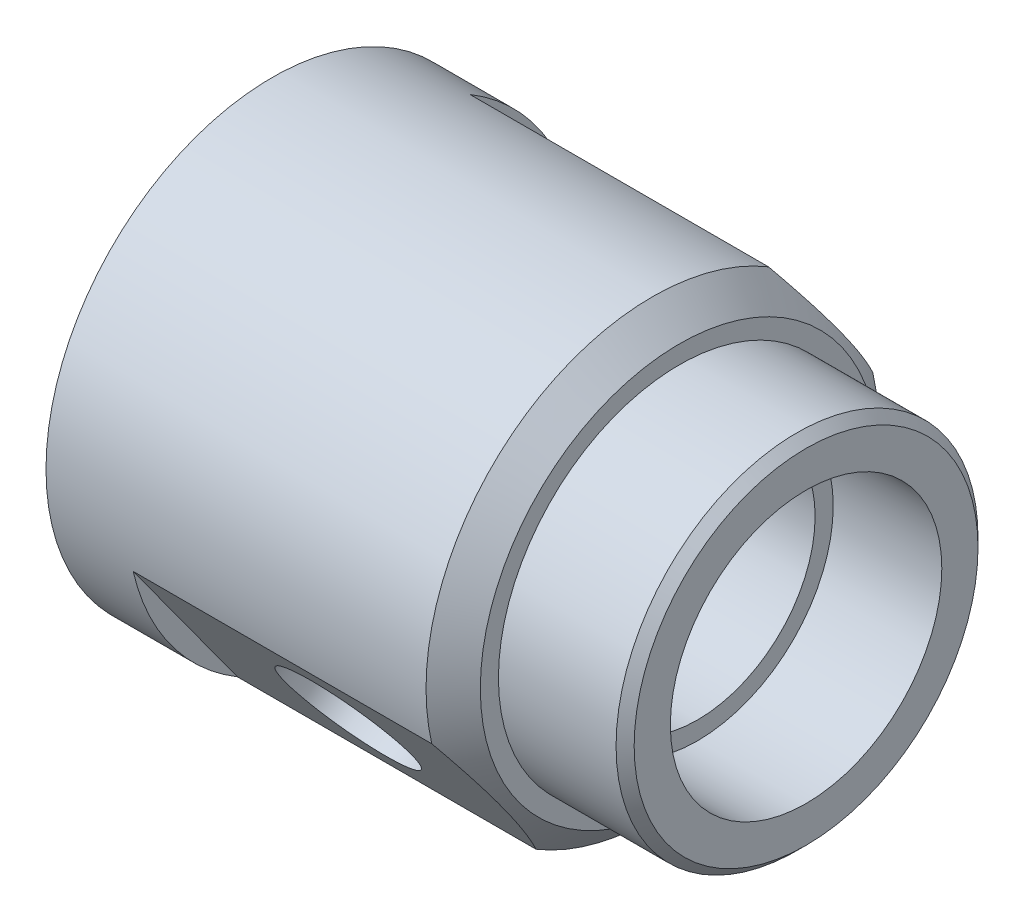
ISO-10303-21;
HEADER;
FILE_DESCRIPTION(('STEP AP214'),'2;1');
FILE_NAME('part.step','',(''),(''),'','','');
FILE_SCHEMA(('AUTOMOTIVE_DESIGN { 1 0 10303 214 1 1 1 1 }'));
ENDSEC;
DATA;
#1=APPLICATION_CONTEXT('core data for automotive mechanical design processes');
#2=APPLICATION_PROTOCOL_DEFINITION('international standard','automotive_design',2000,#1);
#3=PRODUCT_CONTEXT('',#1,'mechanical');
#4=PRODUCT('Part','Part','',(#3));
#5=PRODUCT_RELATED_PRODUCT_CATEGORY('part','',(#4));
#6=PRODUCT_DEFINITION_FORMATION('','',#4);
#7=PRODUCT_DEFINITION_CONTEXT('part definition',#1,'design');
#8=PRODUCT_DEFINITION('design','',#6,#7);
#9=PRODUCT_DEFINITION_SHAPE('','',#8);
#10=(LENGTH_UNIT() NAMED_UNIT(*) SI_UNIT(.MILLI.,.METRE.));
#11=(NAMED_UNIT(*) PLANE_ANGLE_UNIT() SI_UNIT($,.RADIAN.));
#12=(NAMED_UNIT(*) SI_UNIT($,.STERADIAN.) SOLID_ANGLE_UNIT());
#13=UNCERTAINTY_MEASURE_WITH_UNIT(LENGTH_MEASURE(1.E-05),#10,'distance_accuracy_value','');
#14=(GEOMETRIC_REPRESENTATION_CONTEXT(3) GLOBAL_UNCERTAINTY_ASSIGNED_CONTEXT((#13)) GLOBAL_UNIT_ASSIGNED_CONTEXT((#10,
#11,#12)) REPRESENTATION_CONTEXT('',''));
#15=CARTESIAN_POINT('',(0.,0.,0.));
#16=DIRECTION('',(0.,0.,1.));
#17=DIRECTION('',(1.,0.,0.));
#18=AXIS2_PLACEMENT_3D('',#15,#16,#17);
#19=CARTESIAN_POINT('',(-39.,13.079846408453,-14.600260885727));
#20=DIRECTION('',(1.,0.,0.));
#21=DIRECTION('',(0.,-0.809016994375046,-0.587785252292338));
#22=AXIS2_PLACEMENT_3D('',#19,#20,#21);
#23=PLANE('',#22);
#24=CARTESIAN_POINT('',(-39.,12.637382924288,-17.393865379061));
#25=DIRECTION('',(-1.,0.,0.));
#26=DIRECTION('',(0.,0.,1.));
#27=AXIS2_PLACEMENT_3D('',#24,#25,#26);
#28=CIRCLE('',#27,2.00000000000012);
#29=CARTESIAN_POINT('',(-39.,12.637382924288,-15.3938653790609));
#30=VERTEX_POINT('',#29);
#31=EDGE_CURVE('E251',#30,#30,#28,.F.);
#32=ORIENTED_EDGE('',*,*,#31,.F.);
#33=EDGE_LOOP('',(#32));
#34=FACE_BOUND('',#33,.T.);
#35=ADVANCED_FACE('F16',(#34),#23,.F.);
#36=CARTESIAN_POINT('',(-39.,-12.194919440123,20.187469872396));
#37=DIRECTION('',(1.,0.,0.));
#38=DIRECTION('',(0.,-0.809016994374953,-0.587785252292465));
#39=AXIS2_PLACEMENT_3D('',#36,#37,#38);
#40=PLANE('',#39);
#41=CARTESIAN_POINT('',(-39.,-12.637382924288,17.393865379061));
#42=DIRECTION('',(-1.,0.,0.));
#43=DIRECTION('',(0.,0.,1.));
#44=AXIS2_PLACEMENT_3D('',#41,#42,#43);
#45=CIRCLE('',#44,2.00000000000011);
#46=CARTESIAN_POINT('',(-39.,-12.637382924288,19.3938653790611));
#47=VERTEX_POINT('',#46);
#48=EDGE_CURVE('E248',#47,#47,#45,.F.);
#49=ORIENTED_EDGE('',*,*,#48,.F.);
#50=EDGE_LOOP('',(#49));
#51=FACE_BOUND('',#50,.T.);
#52=ADVANCED_FACE('F151',(#51),#40,.F.);
#53=CARTESIAN_POINT('',(-43.,-20.952033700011,3.3184761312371));
#54=DIRECTION('',(-1.,0.,0.));
#55=DIRECTION('',(0.,0.809016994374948,0.587785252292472));
#56=AXIS2_PLACEMENT_3D('',#53,#54,#55);
#57=PLANE('',#56);
#58=CARTESIAN_POINT('',(-43.,0.,0.));
#59=DIRECTION('',(-1.,0.,0.));
#60=DIRECTION('',(0.,0.,1.));
#61=AXIS2_PLACEMENT_3D('',#58,#59,#60);
#62=CIRCLE('',#61,12.9999999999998);
#63=CARTESIAN_POINT('',(-43.,0.,12.9999999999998));
#64=VERTEX_POINT('',#63);
#65=EDGE_CURVE('E246',#64,#64,#62,.T.);
#66=ORIENTED_EDGE('',*,*,#65,.F.);
#67=EDGE_LOOP('',(#66));
#68=FACE_BOUND('',#67,.T.);
#69=CARTESIAN_POINT('',(-43.0000000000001,0.,0.));
#70=DIRECTION('',(-1.,0.,0.));
#71=DIRECTION('',(0.,0.,1.));
#72=AXIS2_PLACEMENT_3D('',#69,#70,#71);
#73=CIRCLE('',#72,14.9999999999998);
#74=CARTESIAN_POINT('',(-43.0000000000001,0.,14.9999999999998));
#75=VERTEX_POINT('',#74);
#76=EDGE_CURVE('E260',#75,#75,#73,.F.);
#77=ORIENTED_EDGE('',*,*,#76,.F.);
#78=EDGE_LOOP('',(#77));
#79=FACE_BOUND('',#78,.T.);
#80=ADVANCED_FACE('F155',(#68,#79),#57,.T.);
#81=CARTESIAN_POINT('',(-43.0000000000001,0.,0.));
#82=DIRECTION('',(-1.,0.,0.));
#83=DIRECTION('',(0.,0.,1.));
#84=AXIS2_PLACEMENT_3D('',#81,#82,#83);
#85=CYLINDRICAL_SURFACE('',#84,14.9999999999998);
#86=ORIENTED_EDGE('',*,*,#76,.T.);
#87=EDGE_LOOP('',(#86));
#88=FACE_BOUND('',#87,.T.);
#89=CARTESIAN_POINT('',(-47.,0.,0.));
#90=DIRECTION('',(-1.,0.,0.));
#91=DIRECTION('',(0.,0.,1.));
#92=AXIS2_PLACEMENT_3D('',#89,#90,#91);
#93=CIRCLE('',#92,14.9999999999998);
#94=CARTESIAN_POINT('',(-47.,0.,14.9999999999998));
#95=VERTEX_POINT('',#94);
#96=EDGE_CURVE('E207',#95,#95,#93,.F.);
#97=ORIENTED_EDGE('',*,*,#96,.F.);
#98=EDGE_LOOP('',(#97));
#99=FACE_BOUND('',#98,.T.);
#100=ADVANCED_FACE('F159',(#88,#99),#85,.F.);
#101=CARTESIAN_POINT('',(-39.,12.637382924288,-17.393865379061));
#102=DIRECTION('',(-1.,0.,0.));
#103=DIRECTION('',(0.,0.,1.));
#104=AXIS2_PLACEMENT_3D('',#101,#102,#103);
#105=CYLINDRICAL_SURFACE('',#104,2.00000000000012);
#106=ORIENTED_EDGE('',*,*,#31,.T.);
#107=EDGE_LOOP('',(#106));
#108=FACE_BOUND('',#107,.T.);
#109=CARTESIAN_POINT('',(-47.,12.637382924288,-17.393865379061));
#110=DIRECTION('',(-1.,0.,0.));
#111=DIRECTION('',(0.,0.,1.));
#112=AXIS2_PLACEMENT_3D('',#109,#110,#111);
#113=CIRCLE('',#112,2.00000000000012);
#114=CARTESIAN_POINT('',(-47.,12.637382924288,-15.3938653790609));
#115=VERTEX_POINT('',#114);
#116=EDGE_CURVE('E202',#115,#115,#113,.F.);
#117=ORIENTED_EDGE('',*,*,#116,.F.);
#118=EDGE_LOOP('',(#117));
#119=FACE_BOUND('',#118,.T.);
#120=ADVANCED_FACE('F268',(#108,#119),#105,.F.);
#121=CARTESIAN_POINT('',(-39.,-12.637382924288,17.393865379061));
#122=DIRECTION('',(-1.,0.,0.));
#123=DIRECTION('',(0.,0.,1.));
#124=AXIS2_PLACEMENT_3D('',#121,#122,#123);
#125=CYLINDRICAL_SURFACE('',#124,2.00000000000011);
#126=ORIENTED_EDGE('',*,*,#48,.T.);
#127=EDGE_LOOP('',(#126));
#128=FACE_BOUND('',#127,.T.);
#129=CARTESIAN_POINT('',(-47.,-12.637382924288,17.393865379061));
#130=DIRECTION('',(-1.,0.,0.));
#131=DIRECTION('',(0.,0.,1.));
#132=AXIS2_PLACEMENT_3D('',#129,#130,#131);
#133=CIRCLE('',#132,2.00000000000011);
#134=CARTESIAN_POINT('',(-47.,-12.637382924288,19.3938653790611));
#135=VERTEX_POINT('',#134);
#136=EDGE_CURVE('E197',#135,#135,#133,.F.);
#137=ORIENTED_EDGE('',*,*,#136,.F.);
#138=EDGE_LOOP('',(#137));
#139=FACE_BOUND('',#138,.T.);
#140=ADVANCED_FACE('F232',(#128,#139),#125,.F.);
#141=CARTESIAN_POINT('',(0.,0.,0.));
#142=DIRECTION('',(-1.,0.,0.));
#143=DIRECTION('',(0.,0.,1.));
#144=AXIS2_PLACEMENT_3D('',#141,#142,#143);
#145=CYLINDRICAL_SURFACE('',#144,12.9999999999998);
#146=ORIENTED_EDGE('',*,*,#65,.T.);
#147=EDGE_LOOP('',(#146));
#148=FACE_BOUND('',#147,.T.);
#149=CARTESIAN_POINT('',(-26.9401139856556,-6.88486211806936,11.0271788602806));
#150=CARTESIAN_POINT('',(-26.9001265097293,-6.6265743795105,11.1884434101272));
#151=CARTESIAN_POINT('',(-26.8402386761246,-6.36482471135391,11.3391824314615));
#152=CARTESIAN_POINT('',(-26.6820678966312,-5.83846807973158,11.6190329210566));
#153=CARTESIAN_POINT('',(-26.5834697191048,-5.57385545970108,11.7479540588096));
#154=CARTESIAN_POINT('',(-26.3496849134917,-5.04742414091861,11.9836373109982));
#155=CARTESIAN_POINT('',(-26.2141434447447,-4.78565956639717,12.090165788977));
#156=CARTESIAN_POINT('',(-25.9088063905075,-4.27094860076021,12.2814951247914));
#157=CARTESIAN_POINT('',(-25.738705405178,-4.01810623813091,12.3660857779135));
#158=CARTESIAN_POINT('',(-25.367075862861,-3.52756117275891,12.5148890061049));
#159=CARTESIAN_POINT('',(-25.1653561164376,-3.28996385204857,12.5789698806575));
#160=CARTESIAN_POINT('',(-24.7337794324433,-2.8364048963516,12.688946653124));
#161=CARTESIAN_POINT('',(-24.5038755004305,-2.62048051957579,12.7348116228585));
#162=CARTESIAN_POINT('',(-24.0196634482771,-2.21675606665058,12.8112476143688));
#163=CARTESIAN_POINT('',(-23.7654464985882,-2.02885719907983,12.8418732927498));
#164=CARTESIAN_POINT('',(-23.2367581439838,-1.68738478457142,12.8911705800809));
#165=CARTESIAN_POINT('',(-22.9624723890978,-1.53353924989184,12.9099393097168));
#166=CARTESIAN_POINT('',(-22.3982036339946,-1.26571193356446,12.9389328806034));
#167=CARTESIAN_POINT('',(-22.1084254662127,-1.15131198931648,12.9492490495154));
#168=CARTESIAN_POINT('',(-21.5181284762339,-0.966775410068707,12.9643324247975));
#169=CARTESIAN_POINT('',(-21.2177527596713,-0.896190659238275,12.9691562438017));
#170=CARTESIAN_POINT('',(-20.6115534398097,-0.802033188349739,12.975323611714));
#171=CARTESIAN_POINT('',(-20.3057767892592,-0.778163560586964,12.9766891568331));
#172=CARTESIAN_POINT('',(-19.6942235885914,-0.778163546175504,12.9766891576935));
#173=CARTESIAN_POINT('',(-19.3884470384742,-0.802033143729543,12.9753236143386));
#174=CARTESIAN_POINT('',(-18.7822478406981,-0.896190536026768,12.9691562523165));
#175=CARTESIAN_POINT('',(-18.4818721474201,-0.966775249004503,12.9643324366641));
#176=CARTESIAN_POINT('',(-17.891575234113,-1.15131173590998,12.9492490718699));
#177=CARTESIAN_POINT('',(-17.6017971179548,-1.26571162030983,12.9389329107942));
#178=CARTESIAN_POINT('',(-17.0375285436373,-1.53353876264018,12.9099393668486));
#179=CARTESIAN_POINT('',(-16.7632429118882,-1.6873841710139,12.8911706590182));
#180=CARTESIAN_POINT('',(-16.2345552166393,-2.02885602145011,12.8418734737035));
#181=CARTESIAN_POINT('',(-15.9803387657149,-2.21675439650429,12.8112478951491));
#182=CARTESIAN_POINT('',(-15.4961281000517,-2.62047733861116,12.7348122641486));
#183=CARTESIAN_POINT('',(-15.2662250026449,-2.83640063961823,12.688947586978));
#184=CARTESIAN_POINT('',(-14.8346475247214,-3.28995961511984,12.5789710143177));
#185=CARTESIAN_POINT('',(-14.6329264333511,-3.52755825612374,12.514889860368));
#186=CARTESIAN_POINT('',(-14.2612955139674,-4.01810490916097,12.3660862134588));
#187=CARTESIAN_POINT('',(-14.0911943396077,-4.27094745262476,12.2814955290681));
#188=CARTESIAN_POINT('',(-13.7858570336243,-4.78565867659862,12.0901661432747));
#189=CARTESIAN_POINT('',(-13.6503154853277,-5.04742332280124,11.9836376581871));
#190=CARTESIAN_POINT('',(-13.4165305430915,-5.57385478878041,11.7479543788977));
#191=CARTESIAN_POINT('',(-13.3179323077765,-5.83846748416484,11.6190332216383));
#192=CARTESIAN_POINT('',(-13.1597614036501,-6.3648243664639,11.339182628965));
#193=CARTESIAN_POINT('',(-13.0998735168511,-6.62657420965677,11.1884435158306));
#194=CARTESIAN_POINT('',(-13.0200858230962,-7.14194014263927,10.8666696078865));
#195=CARTESIAN_POINT('',(-13.0000000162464,-7.39558858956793,10.6957331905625));
#196=CARTESIAN_POINT('',(-12.9999999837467,-7.89013242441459,10.3363074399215));
#197=CARTESIAN_POINT('',(-13.0200861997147,-8.13102767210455,10.1478179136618));
#198=CARTESIAN_POINT('',(-13.099873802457,-8.59619685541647,9.75695442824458));
#199=CARTESIAN_POINT('',(-13.1597620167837,-8.82038683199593,9.55451904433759));
#200=CARTESIAN_POINT('',(-13.3179327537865,-9.2490813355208,9.14024833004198));
#201=CARTESIAN_POINT('',(-13.4165311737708,-9.45340618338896,8.92834870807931));
#202=CARTESIAN_POINT('',(-13.6503158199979,-9.84011906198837,8.50036016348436));
#203=CARTESIAN_POINT('',(-13.7858573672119,-10.022267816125,8.28425053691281));
#204=CARTESIAN_POINT('',(-14.0911941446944,-10.3631776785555,7.8537053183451));
#205=CARTESIAN_POINT('',(-14.2612950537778,-10.521706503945,7.63930377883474));
#206=CARTESIAN_POINT('',(-14.6329242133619,-10.8147072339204,7.21860494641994));
#207=CARTESIAN_POINT('',(-14.8346437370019,-10.9490212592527,7.01236723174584));
#208=CARTESIAN_POINT('',(-15.2662199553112,-11.1936717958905,6.61485347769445));
#209=CARTESIAN_POINT('',(-15.496123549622,-11.3039674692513,6.42360326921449));
#210=CARTESIAN_POINT('',(-15.9803351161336,-11.501327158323,6.06313118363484));
#211=CARTESIAN_POINT('',(-16.2345516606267,-11.5884738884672,5.8938320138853));
#212=CARTESIAN_POINT('',(-16.763239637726,-11.7407976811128,5.58419436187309));
#213=CARTESIAN_POINT('',(-17.0375250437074,-11.8061514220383,5.44362674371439));
#214=CARTESIAN_POINT('',(-17.6017937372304,-11.9164230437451,5.19777642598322));
#215=CARTESIAN_POINT('',(-17.8915717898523,-11.9615572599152,5.09212353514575));
#216=CARTESIAN_POINT('',(-18.481869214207,-12.0328805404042,4.9212152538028));
#217=CARTESIAN_POINT('',(-18.7822451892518,-12.0592621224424,4.85555037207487));
#218=CARTESIAN_POINT('',(-19.3884453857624,-12.0941995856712,4.76787348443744));
#219=CARTESIAN_POINT('',(-19.6942225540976,-12.1028682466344,4.74558533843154));
#220=CARTESIAN_POINT('',(-20.3057768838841,-12.1028682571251,4.74558531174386));
#221=CARTESIAN_POINT('',(-20.6115540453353,-12.0941996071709,4.76787342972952));
#222=CARTESIAN_POINT('',(-21.217754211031,-12.0592621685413,4.85555025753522));
#223=CARTESIAN_POINT('',(-21.5181301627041,-12.0328806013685,4.92121510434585));
#224=CARTESIAN_POINT('',(-22.10842751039,-11.9615573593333,5.09212330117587));
#225=CARTESIAN_POINT('',(-22.3982055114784,-11.9164231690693,5.19777613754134));
#226=CARTESIAN_POINT('',(-22.9624740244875,-11.8061516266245,5.44362629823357));
#227=CARTESIAN_POINT('',(-23.2367593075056,-11.7407979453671,5.58419380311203));
#228=CARTESIAN_POINT('',(-23.7654466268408,-11.5884744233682,5.89383095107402));
#229=CARTESIAN_POINT('',(-24.0196626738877,-11.5013279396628,6.06312968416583));
#230=CARTESIAN_POINT('',(-24.503872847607,-11.3039690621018,6.42360043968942));
#231=CARTESIAN_POINT('',(-24.7337756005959,-11.1936740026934,6.61484970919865));
#232=CARTESIAN_POINT('',(-25.1653526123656,-10.9490236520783,7.01236354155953));
#233=CARTESIAN_POINT('',(-25.3670734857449,-10.8147089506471,7.21860243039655));
#234=CARTESIAN_POINT('',(-25.7387040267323,-10.5217073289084,7.63930264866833));
#235=CARTESIAN_POINT('',(-25.9088051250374,-10.3631784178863,7.85370435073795));
#236=CARTESIAN_POINT('',(-26.2141421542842,-10.0222684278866,8.28424979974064));
#237=CARTESIAN_POINT('',(-26.3496837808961,-9.84011964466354,8.50035949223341));
#238=CARTESIAN_POINT('',(-26.583468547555,-9.45340672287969,8.92834813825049));
#239=CARTESIAN_POINT('',(-26.6820670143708,-9.24908186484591,9.14024779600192));
#240=CARTESIAN_POINT('',(-26.8402378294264,-8.82038734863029,9.55451856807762));
#241=CARTESIAN_POINT('',(-26.9001260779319,-8.59619737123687,9.75695397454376));
#242=CARTESIAN_POINT('',(-26.9799137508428,-8.13102814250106,10.1478175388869));
#243=CARTESIAN_POINT('',(-26.9999999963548,-7.89013284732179,10.3363071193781));
#244=CARTESIAN_POINT('',(-27.0000000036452,-7.39558884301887,10.6957330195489));
#245=CARTESIAN_POINT('',(-26.9799141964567,-7.14194027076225,10.8666695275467));
#246=CARTESIAN_POINT('',(-26.9401139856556,-6.88486211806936,11.0271788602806));
#247=B_SPLINE_CURVE_WITH_KNOTS('',3,(#149,#150,#151,#152,#153,#154,#155,#156,#157,#158,#159,
#160,#161,#162,#163,#164,#165,#166,#167,#168,#169,#170,#171,#172,#173,#174,#175,#176,#177,#178,
#179,#180,#181,#182,#183,#184,#185,#186,#187,#188,#189,#190,#191,#192,#193,#194,#195,#196,#197,
#198,#199,#200,#201,#202,#203,#204,#205,#206,#207,#208,#209,#210,#211,#212,#213,#214,#215,#216,
#217,#218,#219,#220,#221,#222,#223,#224,#225,#226,#227,#228,#229,#230,#231,#232,#233,#234,#235,
#236,#237,#238,#239,#240,#241,#242,#243,#244,#245,#246),.UNSPECIFIED.,.T.,.F.,(4,2,2,2,2,2,2,2,
2,2,2,2,2,2,2,2,2,2,2,2,2,2,2,2,2,2,2,2,2,2,2,2,2,2,2,2,2,2,2,2,2,2,2,2,2,2,2,2,4),(0.,
0.920514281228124,1.84868551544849,2.78610671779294,3.73220339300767,4.68425876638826,
5.63792376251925,6.58814327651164,7.53047499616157,8.46248557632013,9.38479988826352,
10.301232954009,11.2176657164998,12.1399799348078,13.0719903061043,14.0143215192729,
14.9645389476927,15.9181998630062,16.8702608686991,17.8163583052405,18.7537797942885,
19.6819512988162,20.6024661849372,21.518669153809,22.4348821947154,23.3554265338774,
24.2836446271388,25.2211262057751,26.1672921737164,27.119420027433,28.0731543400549,
29.0234335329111,29.9658099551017,30.897847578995,31.8201728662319,32.7366070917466,
33.6530412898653,34.575366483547,35.5074038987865,36.4497798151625,37.4000569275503,
38.3537871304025,39.3059206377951,40.2520873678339,41.18956923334,42.1177874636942,
43.0383318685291,43.9545451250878,44.8707485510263),.UNSPECIFIED.);
#248=CARTESIAN_POINT('',(-26.9401139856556,-6.88486211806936,11.0271788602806));
#249=VERTEX_POINT('',#248);
#250=EDGE_CURVE('E212',#249,#249,#247,.T.);
#251=ORIENTED_EDGE('',*,*,#250,.F.);
#252=EDGE_LOOP('',(#251));
#253=FACE_BOUND('',#252,.T.);
#254=CARTESIAN_POINT('',(-26.9401139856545,6.88139060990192,-11.0293455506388));
#255=CARTESIAN_POINT('',(-26.9001261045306,6.62304375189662,-11.1905340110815));
#256=CARTESIAN_POINT('',(-26.8402379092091,6.36123790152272,-11.3411952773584));
#257=CARTESIAN_POINT('',(-26.6820672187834,5.83476934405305,-11.6208911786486));
#258=CARTESIAN_POINT('',(-26.5834688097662,5.57010101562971,-11.7497350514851));
#259=CARTESIAN_POINT('',(-26.349684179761,5.04355890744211,-11.9852651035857));
#260=CARTESIAN_POINT('',(-26.214142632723,4.78173937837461,-12.0917173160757));
#261=CARTESIAN_POINT('',(-25.9088058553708,4.26691960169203,-12.2828960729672));
#262=CARTESIAN_POINT('',(-25.7387049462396,4.0140235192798,-12.3674122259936));
#263=CARTESIAN_POINT('',(-25.3670757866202,3.52337294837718,-12.5160693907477));
#264=CARTESIAN_POINT('',(-25.165356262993,3.28572390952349,-12.5800786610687));
#265=CARTESIAN_POINT('',(-24.7337800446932,2.83206468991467,-12.6899166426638));
#266=CARTESIAN_POINT('',(-24.5038764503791,2.61609169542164,-12.7357144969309));
#267=CARTESIAN_POINT('',(-24.019664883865,2.21227487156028,-12.8120227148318));
#268=CARTESIAN_POINT('',(-23.7654483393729,2.02433197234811,-12.8425878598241));
#269=CARTESIAN_POINT('',(-23.2367603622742,1.68277842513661,-12.8917730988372));
#270=CARTESIAN_POINT('',(-22.9624749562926,1.52889525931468,-12.9104904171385));
#271=CARTESIAN_POINT('',(-22.3982062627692,1.26100190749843,-12.9393930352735));
#272=CARTESIAN_POINT('',(-22.1084282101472,1.14657279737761,-12.9496696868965));
#273=CARTESIAN_POINT('',(-21.5181307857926,0.961989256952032,-12.9646885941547));
#274=CARTESIAN_POINT('',(-21.217754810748,0.891385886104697,-12.9694874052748));
#275=CARTESIAN_POINT('',(-20.6115546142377,0.797203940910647,-12.9756212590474));
#276=CARTESIAN_POINT('',(-20.3057774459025,0.773327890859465,-12.9769782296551));
#277=CARTESIAN_POINT('',(-19.6942231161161,0.773327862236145,-12.9769782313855));
#278=CARTESIAN_POINT('',(-19.3884459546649,0.797203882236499,-12.9756212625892));
#279=CARTESIAN_POINT('',(-18.7822457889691,0.891385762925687,-12.9694874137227));
#280=CARTESIAN_POINT('',(-18.4818698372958,0.961989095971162,-12.9646886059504));
#281=CARTESIAN_POINT('',(-17.8915724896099,1.14657254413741,-12.949669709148));
#282=CARTESIAN_POINT('',(-17.6017944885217,1.26100159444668,-12.9393930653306));
#283=CARTESIAN_POINT('',(-17.0375259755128,1.52889477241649,-12.9104904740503));
#284=CARTESIAN_POINT('',(-16.7632406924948,1.68277781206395,-12.8917731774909));
#285=CARTESIAN_POINT('',(-16.2345533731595,2.02433079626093,-12.8425880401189));
#286=CARTESIAN_POINT('',(-15.9803373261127,2.21227320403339,-12.8120229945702));
#287=CARTESIAN_POINT('',(-15.4961271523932,2.61608851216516,-12.7357151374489));
#288=CARTESIAN_POINT('',(-15.2662243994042,2.83206042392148,-12.6899175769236));
#289=CARTESIAN_POINT('',(-14.8346473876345,3.28571966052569,-12.5800797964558));
#290=CARTESIAN_POINT('',(-14.6329265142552,3.52337002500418,-12.5160702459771));
#291=CARTESIAN_POINT('',(-14.2612959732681,4.01402218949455,-12.3674126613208));
#292=CARTESIAN_POINT('',(-14.0911948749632,4.26691845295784,-12.2828964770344));
#293=CARTESIAN_POINT('',(-13.7858578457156,4.7817384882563,-12.0917176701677));
#294=CARTESIAN_POINT('',(-13.6503162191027,5.04355808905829,-11.9852654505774));
#295=CARTESIAN_POINT('',(-13.4165314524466,5.57010034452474,-11.7497353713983));
#296=CARTESIAN_POINT('',(-13.3179329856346,5.83476874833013,-11.620891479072));
#297=CARTESIAN_POINT('',(-13.1597621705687,6.36123755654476,-11.3411954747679));
#298=CARTESIAN_POINT('',(-13.0998739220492,6.62304358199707,-11.1905341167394));
#299=CARTESIAN_POINT('',(-13.0200862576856,7.13852206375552,-10.8689154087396));
#300=CARTESIAN_POINT('',(-13.000000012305,7.3922269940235,-10.6980568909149));
#301=CARTESIAN_POINT('',(-12.9999999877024,7.88688366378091,-10.3387864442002));
#302=CARTESIAN_POINT('',(-13.0200857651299,8.12783554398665,-10.1503747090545));
#303=CARTESIAN_POINT('',(-13.099873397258,8.5931175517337,-9.75966622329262));
#304=CARTESIAN_POINT('',(-13.1597612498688,8.81736411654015,-9.55730829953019));
#305=CARTESIAN_POINT('',(-13.3179320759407,9.24617105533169,-9.14319180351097));
#306=CARTESIAN_POINT('',(-13.4165302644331,9.45055217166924,-8.93136903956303));
#307=CARTESIAN_POINT('',(-13.6503150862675,9.83737651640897,-8.50353320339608));
#308=CARTESIAN_POINT('',(-13.7858565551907,10.0195808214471,-8.28749940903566));
#309=CARTESIAN_POINT('',(-14.0911936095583,10.3606002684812,-7.85710420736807));
#310=CARTESIAN_POINT('',(-14.2612945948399,10.5191833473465,-7.64277678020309));
#311=CARTESIAN_POINT('',(-14.6329241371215,10.8122903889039,-7.22222342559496));
#312=CARTESIAN_POINT('',(-14.8346438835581,10.9466565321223,-7.01605702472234));
#313=CARTESIAN_POINT('',(-15.2662205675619,11.1914080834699,-6.61868151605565));
#314=CARTESIAN_POINT('',(-15.496124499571,11.3017525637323,-6.42749828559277));
#315=CARTESIAN_POINT('',(-15.9803365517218,11.4992052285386,-6.06715353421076));
#316=CARTESIAN_POINT('',(-16.2345535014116,11.5863959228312,-5.89791494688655));
#317=CARTESIAN_POINT('',(-16.7632418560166,11.7388012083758,-5.58838908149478));
#318=CARTESIAN_POINT('',(-17.0375276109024,11.8041922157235,-5.44787313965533));
#319=CARTESIAN_POINT('',(-17.6017963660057,11.914529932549,-5.20211373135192));
#320=CARTESIAN_POINT('',(-17.8915745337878,11.9596927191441,-5.09650079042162));
#321=CARTESIAN_POINT('',(-18.4818715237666,12.0310628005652,-4.92565709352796));
#322=CARTESIAN_POINT('',(-18.7822472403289,12.0574624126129,-4.86001764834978));
#323=CARTESIAN_POINT('',(-19.3884465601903,12.0924241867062,-4.77237439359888));
#324=CARTESIAN_POINT('',(-19.6942232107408,12.1010990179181,-4.75009500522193));
#325=CARTESIAN_POINT('',(-20.3057764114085,12.1010990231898,-4.7500949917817));
#326=CARTESIAN_POINT('',(-20.6115529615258,12.0924242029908,-4.77237435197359));
#327=CARTESIAN_POINT('',(-21.217752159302,12.0574624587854,-4.86001753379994));
#328=CARTESIAN_POINT('',(-21.5181278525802,12.0310628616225,-4.92565694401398));
#329=CARTESIAN_POINT('',(-22.1084247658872,11.9596928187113,-5.09650055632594));
#330=CARTESIAN_POINT('',(-22.3982028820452,11.914530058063,-5.20211344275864));
#331=CARTESIAN_POINT('',(-22.9624714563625,11.8041924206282,-5.44787269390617));
#332=CARTESIAN_POINT('',(-23.2367570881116,11.7388014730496,-5.58838852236));
#333=CARTESIAN_POINT('',(-23.7654447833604,11.5863964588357,-5.8979138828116));
#334=CARTESIAN_POINT('',(-24.0196612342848,11.499206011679,-6.06715203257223));
#335=CARTESIAN_POINT('',(-24.503871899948,11.3017541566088,-6.42749545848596));
#336=CARTESIAN_POINT('',(-24.7337749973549,11.1914102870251,-6.61867775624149));
#337=CARTESIAN_POINT('',(-25.1653524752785,10.9466589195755,-7.01605334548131));
#338=CARTESIAN_POINT('',(-25.3670735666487,10.8122921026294,-7.22222091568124));
#339=CARTESIAN_POINT('',(-25.7387044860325,10.5191841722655,-7.64277565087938));
#340=CARTESIAN_POINT('',(-25.9088056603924,10.3606010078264,-7.85710324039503));
#341=CARTESIAN_POINT('',(-26.214142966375,10.0195814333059,-8.28749867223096));
#342=CARTESIAN_POINT('',(-26.3496845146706,9.8373770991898,-8.50353253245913));
#343=CARTESIAN_POINT('',(-26.5834694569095,9.45055271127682,-8.93136846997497));
#344=CARTESIAN_POINT('',(-26.682067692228,9.24617158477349,-9.14319126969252));
#345=CARTESIAN_POINT('',(-26.8402385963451,8.81736463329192,-9.55730782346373));
#346=CARTESIAN_POINT('',(-26.9001264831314,8.59311806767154,-9.75966576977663));
#347=CARTESIAN_POINT('',(-26.9799141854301,8.12783601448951,-10.1503743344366));
#348=CARTESIAN_POINT('',(-26.9999999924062,7.88688408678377,-10.3387861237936));
#349=CARTESIAN_POINT('',(-27.0000000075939,7.39222724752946,-10.6980567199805));
#350=CARTESIAN_POINT('',(-26.9799137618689,7.1385221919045,-10.8689153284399));
#351=CARTESIAN_POINT('',(-26.9401139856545,6.88139060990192,-11.0293455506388));
#352=B_SPLINE_CURVE_WITH_KNOTS('',3,(#254,#255,#256,#257,#258,#259,#260,#261,#262,#263,#264,
#265,#266,#267,#268,#269,#270,#271,#272,#273,#274,#275,#276,#277,#278,#279,#280,#281,#282,#283,
#284,#285,#286,#287,#288,#289,#290,#291,#292,#293,#294,#295,#296,#297,#298,#299,#300,#301,#302,
#303,#304,#305,#306,#307,#308,#309,#310,#311,#312,#313,#314,#315,#316,#317,#318,#319,#320,#321,
#322,#323,#324,#325,#326,#327,#328,#329,#330,#331,#332,#333,#334,#335,#336,#337,#338,#339,#340,
#341,#342,#343,#344,#345,#346,#347,#348,#349,#350,#351),.UNSPECIFIED.,.T.,.F.,(4,2,2,2,2,2,2,2,
2,2,2,2,2,2,2,2,2,2,2,2,2,2,2,2,2,2,2,2,2,2,2,2,2,2,2,2,2,2,2,2,2,2,2,2,2,2,2,2,4),(0.,
0.920543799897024,1.8487617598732,2.78624333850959,3.73240930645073,4.68453716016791,
5.6382714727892,6.58855066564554,7.53092708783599,8.46296471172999,9.38528999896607,
10.3017242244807,11.2181584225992,12.1404836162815,13.0725210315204,14.0148969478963,
14.9651740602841,15.9189042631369,16.8710377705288,17.8172045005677,18.7546863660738,
19.6829045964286,20.6034490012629,21.5196620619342,22.4358650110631,23.3563798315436,
24.2845511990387,25.2219724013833,26.1680690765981,27.120124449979,28.0737894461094,
29.0240089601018,29.9663406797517,30.8983512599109,31.8206655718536,32.737098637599,
33.6535314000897,34.5758456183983,35.5078559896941,36.4501872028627,37.4004046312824,
38.354065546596,39.306126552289,40.2522239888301,41.189645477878,42.1178169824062,
43.038331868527,43.9545350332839,44.8707485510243),.UNSPECIFIED.);
#353=CARTESIAN_POINT('',(-26.9401139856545,6.88139060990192,-11.0293455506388));
#354=VERTEX_POINT('',#353);
#355=EDGE_CURVE('E221',#354,#354,#352,.T.);
#356=ORIENTED_EDGE('',*,*,#355,.F.);
#357=EDGE_LOOP('',(#356));
#358=FACE_BOUND('',#357,.T.);
#359=CARTESIAN_POINT('',(0.,0.,0.));
#360=DIRECTION('',(-1.,0.,0.));
#361=DIRECTION('',(0.,0.,1.));
#362=AXIS2_PLACEMENT_3D('',#359,#360,#361);
#363=CIRCLE('',#362,12.9999999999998);
#364=CARTESIAN_POINT('',(0.,0.,12.9999999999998));
#365=VERTEX_POINT('',#364);
#366=EDGE_CURVE('E96',#365,#365,#363,.T.);
#367=ORIENTED_EDGE('',*,*,#366,.F.);
#368=EDGE_LOOP('',(#367));
#369=FACE_BOUND('',#368,.T.);
#370=ADVANCED_FACE('F227',(#148,#253,#358,#369),#145,.F.);
#371=CARTESIAN_POINT('',(-20.,6.39396105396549,-8.80400480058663));
#372=DIRECTION('',(0.,0.587785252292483,-0.809016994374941));
#373=DIRECTION('',(0.,0.809016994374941,0.587785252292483));
#374=AXIS2_PLACEMENT_3D('',#371,#372,#373);
#375=CYLINDRICAL_SURFACE('',#374,7.);
#376=CARTESIAN_POINT('',(-20.,13.517409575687,-18.608590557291));
#377=DIRECTION('',(0.,0.587785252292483,-0.809016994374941));
#378=DIRECTION('',(0.,0.809016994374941,0.587785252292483));
#379=AXIS2_PLACEMENT_3D('',#376,#377,#378);
#380=CIRCLE('',#379,7.);
#381=CARTESIAN_POINT('',(-20.,19.1805285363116,-14.4940937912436));
#382=VERTEX_POINT('',#381);
#383=EDGE_CURVE('E95',#382,#382,#380,.T.);
#384=ORIENTED_EDGE('',*,*,#383,.T.);
#385=EDGE_LOOP('',(#384));
#386=FACE_BOUND('',#385,.T.);
#387=ORIENTED_EDGE('',*,*,#355,.T.);
#388=EDGE_LOOP('',(#387));
#389=FACE_BOUND('',#388,.T.);
#390=ADVANCED_FACE('F231',(#386,#389),#375,.F.);
#391=CARTESIAN_POINT('',(-20.,-13.520712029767,18.606191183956));
#392=DIRECTION('',(0.,0.587785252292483,-0.809016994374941));
#393=DIRECTION('',(0.,0.809016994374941,0.587785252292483));
#394=AXIS2_PLACEMENT_3D('',#391,#392,#393);
#395=CYLINDRICAL_SURFACE('',#394,7.);
#396=ORIENTED_EDGE('',*,*,#250,.T.);
#397=EDGE_LOOP('',(#396));
#398=FACE_BOUND('',#397,.T.);
#399=CARTESIAN_POINT('',(-20.,-13.520712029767,18.606191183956));
#400=DIRECTION('',(0.,0.587785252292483,-0.809016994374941));
#401=DIRECTION('',(0.,0.809016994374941,0.587785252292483));
#402=AXIS2_PLACEMENT_3D('',#399,#400,#401);
#403=CIRCLE('',#402,7.);
#404=CARTESIAN_POINT('',(-20.,-7.85759306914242,22.7206879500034));
#405=VERTEX_POINT('',#404);
#406=EDGE_CURVE('E99',#405,#405,#403,.F.);
#407=ORIENTED_EDGE('',*,*,#406,.T.);
#408=EDGE_LOOP('',(#407));
#409=FACE_BOUND('',#408,.T.);
#410=ADVANCED_FACE('F165',(#398,#409),#395,.F.);
#411=CARTESIAN_POINT('',(-47.,-34.920056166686,5.5307935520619));
#412=DIRECTION('',(-1.,0.,0.));
#413=DIRECTION('',(0.,0.809016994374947,0.587785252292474));
#414=AXIS2_PLACEMENT_3D('',#411,#412,#413);
#415=PLANE('',#414);
#416=ORIENTED_EDGE('',*,*,#136,.T.);
#417=EDGE_LOOP('',(#416));
#418=FACE_BOUND('',#417,.T.);
#419=ORIENTED_EDGE('',*,*,#116,.T.);
#420=EDGE_LOOP('',(#419));
#421=FACE_BOUND('',#420,.T.);
#422=ORIENTED_EDGE('',*,*,#96,.T.);
#423=EDGE_LOOP('',(#422));
#424=FACE_BOUND('',#423,.T.);
#425=CARTESIAN_POINT('',(-47.,0.,0.));
#426=DIRECTION('',(-1.,0.,0.));
#427=DIRECTION('',(0.,0.,1.));
#428=AXIS2_PLACEMENT_3D('',#425,#426,#427);
#429=CIRCLE('',#428,25.0000000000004);
#430=CARTESIAN_POINT('',(-47.,0.,25.0000000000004));
#431=VERTEX_POINT('',#430);
#432=EDGE_CURVE('E102',#431,#431,#429,.T.);
#433=ORIENTED_EDGE('',*,*,#432,.T.);
#434=EDGE_LOOP('',(#433));
#435=FACE_BOUND('',#434,.T.);
#436=ADVANCED_FACE('F161',(#418,#421,#424,#435),#415,.T.);
#437=CARTESIAN_POINT('',(-38.,22.621346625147,-14.466329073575));
#438=DIRECTION('',(-1.,0.,0.));
#439=DIRECTION('',(0.,-0.809016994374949,-0.587785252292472));
#440=AXIS2_PLACEMENT_3D('',#437,#438,#439);
#441=PLANE('',#440);
#442=CARTESIAN_POINT('',(-38.0000000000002,0.,0.));
#443=DIRECTION('',(-1.,0.,0.));
#444=DIRECTION('',(0.,0.,1.));
#445=AXIS2_PLACEMENT_3D('',#442,#443,#444);
#446=CIRCLE('',#445,25.0000000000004);
#447=CARTESIAN_POINT('',(-38.0000000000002,-5.59234548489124,24.3664866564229));
#448=VERTEX_POINT('',#447);
#449=CARTESIAN_POINT('',(-38.0000000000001,-21.4457761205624,12.8482950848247));
#450=VERTEX_POINT('',#449);
#451=EDGE_CURVE('E86',#448,#450,#446,.F.);
#452=ORIENTED_EDGE('',*,*,#451,.T.);
#453=DIRECTION('',(0.,0.809016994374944,0.587785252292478));
#454=VECTOR('',#453,1.);
#455=CARTESIAN_POINT('',(-38.,-7.2879787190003,23.1345369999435));
#456=LINE('',#455,#454);
#457=EDGE_CURVE('E97',#450,#448,#456,.T.);
#458=ORIENTED_EDGE('',*,*,#457,.T.);
#459=EDGE_LOOP('',(#452,#458));
#460=FACE_BOUND('',#459,.T.);
#461=ADVANCED_FACE('F164',(#460),#441,.F.);
#462=CARTESIAN_POINT('',(-38.,23.8991406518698,-16.2250616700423));
#463=DIRECTION('',(-1.,0.,0.));
#464=DIRECTION('',(0.,-0.809016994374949,-0.587785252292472));
#465=AXIS2_PLACEMENT_3D('',#462,#463,#464);
#466=PLANE('',#465);
#467=CARTESIAN_POINT('',(-38.0000000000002,0.,0.));
#468=DIRECTION('',(-1.,0.,0.));
#469=DIRECTION('',(0.,0.,1.));
#470=AXIS2_PLACEMENT_3D('',#467,#468,#469);
#471=CIRCLE('',#470,25.0000000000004);
#472=CARTESIAN_POINT('',(-38.0000000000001,5.59234548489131,-24.3664866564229));
#473=VERTEX_POINT('',#472);
#474=CARTESIAN_POINT('',(-38.0000000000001,21.4457761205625,-12.8482950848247));
#475=VERTEX_POINT('',#474);
#476=EDGE_CURVE('E77',#473,#475,#471,.F.);
#477=ORIENTED_EDGE('',*,*,#476,.T.);
#478=DIRECTION('',(0.,-0.809016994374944,-0.587785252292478));
#479=VECTOR('',#478,1.);
#480=CARTESIAN_POINT('',(-38.,7.2879787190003,-23.1345369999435));
#481=LINE('',#480,#479);
#482=EDGE_CURVE('E93',#475,#473,#481,.T.);
#483=ORIENTED_EDGE('',*,*,#482,.T.);
#484=EDGE_LOOP('',(#477,#483));
#485=FACE_BOUND('',#484,.T.);
#486=ADVANCED_FACE('F169',(#485),#466,.F.);
#487=CARTESIAN_POINT('',(0.,-3.3184761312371,-20.952033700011));
#488=DIRECTION('',(1.,0.,0.));
#489=DIRECTION('',(0.,0.809016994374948,0.587785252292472));
#490=AXIS2_PLACEMENT_3D('',#487,#488,#489);
#491=PLANE('',#490);
#492=ORIENTED_EDGE('',*,*,#366,.T.);
#493=EDGE_LOOP('',(#492));
#494=FACE_BOUND('',#493,.T.);
#495=CARTESIAN_POINT('',(2.68882138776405E-13,0.,0.));
#496=DIRECTION('',(-1.,0.,0.));
#497=DIRECTION('',(0.,0.,1.));
#498=AXIS2_PLACEMENT_3D('',#495,#496,#497);
#499=CIRCLE('',#498,14.9999999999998);
#500=CARTESIAN_POINT('',(2.68882138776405E-13,0.,14.9999999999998));
#501=VERTEX_POINT('',#500);
#502=EDGE_CURVE('E69',#501,#501,#499,.T.);
#503=ORIENTED_EDGE('',*,*,#502,.F.);
#504=EDGE_LOOP('',(#503));
#505=FACE_BOUND('',#504,.T.);
#506=ADVANCED_FACE('F173',(#494,#505),#491,.T.);
#507=CARTESIAN_POINT('',(-3.,21.445776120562,-12.848295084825));
#508=DIRECTION('',(0.,-0.587785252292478,0.809016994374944));
#509=DIRECTION('',(-1.,0.,0.));
#510=AXIS2_PLACEMENT_3D('',#507,#508,#509);
#511=PLANE('',#510);
#512=ORIENTED_EDGE('',*,*,#383,.F.);
#513=EDGE_LOOP('',(#512));
#514=FACE_BOUND('',#513,.T.);
#515=DIRECTION('',(1.,0.,0.));
#516=VECTOR('',#515,1.);
#517=CARTESIAN_POINT('',(-26.,21.4457761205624,-12.8482950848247));
#518=LINE('',#517,#516);
#519=CARTESIAN_POINT('',(-4.99999999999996,21.4457761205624,-12.8482950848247));
#520=VERTEX_POINT('',#519);
#521=EDGE_CURVE('E65',#475,#520,#518,.T.);
#522=ORIENTED_EDGE('',*,*,#521,.T.);
#523=CARTESIAN_POINT('',(-4.99999999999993,21.4457761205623,-12.8482950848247));
#524=CARTESIAN_POINT('',(-4.96464834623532,21.3728020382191,-12.9013138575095));
#525=CARTESIAN_POINT('',(-4.92965187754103,21.299707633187,-12.9544200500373));
#526=CARTESIAN_POINT('',(-4.5873684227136,20.5760940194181,-13.4801561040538));
#527=CARTESIAN_POINT('',(-4.30853459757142,19.9163144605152,-13.9595140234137));
#528=CARTESIAN_POINT('',(-3.9440143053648,18.9141571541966,-14.6876239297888));
#529=CARTESIAN_POINT('',(-3.83146615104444,18.5780375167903,-14.9318291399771));
#530=CARTESIAN_POINT('',(-3.625951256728,17.9019213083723,-15.4230563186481));
#531=CARTESIAN_POINT('',(-3.53297955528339,17.5619257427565,-15.6700775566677));
#532=CARTESIAN_POINT('',(-3.42368938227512,17.1087221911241,-15.9993492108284));
#533=CARTESIAN_POINT('',(-3.39791170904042,16.9969697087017,-16.0805421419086));
#534=CARTESIAN_POINT('',(-3.34323715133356,16.7484780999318,-16.2610818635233));
#535=CARTESIAN_POINT('',(-3.31490379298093,16.611656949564,-16.3604882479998));
#536=CARTESIAN_POINT('',(-3.26179676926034,16.3377739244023,-16.5594759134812));
#537=CARTESIAN_POINT('',(-3.23701785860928,16.2007127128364,-16.6590567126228));
#538=CARTESIAN_POINT('',(-3.18598129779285,15.8959470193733,-16.8804819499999));
#539=CARTESIAN_POINT('',(-3.16060101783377,15.7281454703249,-17.0023969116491));
#540=CARTESIAN_POINT('',(-3.11943494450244,15.4227071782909,-17.2243108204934));
#541=CARTESIAN_POINT('',(-3.10274352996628,15.2851494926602,-17.324252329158));
#542=CARTESIAN_POINT('',(-3.06978918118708,14.9793352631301,-17.5464393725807));
#543=CARTESIAN_POINT('',(-3.05443631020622,14.8110132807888,-17.6687324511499));
#544=CARTESIAN_POINT('',(-3.03624178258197,14.5667864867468,-17.8461736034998));
#545=CARTESIAN_POINT('',(-3.03116398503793,14.4909862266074,-17.901245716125));
#546=CARTESIAN_POINT('',(-3.02114733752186,14.3225191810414,-18.0236441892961));
#547=CARTESIAN_POINT('',(-3.01648922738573,14.2298412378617,-18.0909786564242));
#548=CARTESIAN_POINT('',(-3.00888179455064,14.0444566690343,-18.2256684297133));
#549=CARTESIAN_POINT('',(-3.00593216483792,13.9517500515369,-18.2930237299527));
#550=CARTESIAN_POINT('',(-3.00128006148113,13.7457198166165,-18.4427134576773));
#551=CARTESIAN_POINT('',(-3.00000002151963,13.6323897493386,-18.5250525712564));
#552=CARTESIAN_POINT('',(-2.999999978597,13.4063444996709,-18.6892840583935));
#553=CARTESIAN_POINT('',(-3.00126613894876,13.2936293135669,-18.7711764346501));
#554=CARTESIAN_POINT('',(-3.00689127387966,13.0431591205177,-18.9531536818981));
#555=CARTESIAN_POINT('',(-3.01187572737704,12.9054129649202,-19.0532321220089));
#556=CARTESIAN_POINT('',(-3.02561214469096,12.6299632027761,-19.2533580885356));
#557=CARTESIAN_POINT('',(-3.03436634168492,12.4922596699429,-19.3534055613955));
#558=CARTESIAN_POINT('',(-3.057985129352,12.1863187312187,-19.5756846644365));
#559=CARTESIAN_POINT('',(-3.07377752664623,12.0181275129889,-19.6978827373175));
#560=CARTESIAN_POINT('',(-3.1075294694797,11.7124594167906,-19.91996360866));
#561=CARTESIAN_POINT('',(-3.12458386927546,11.57491623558,-20.0198945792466));
#562=CARTESIAN_POINT('',(-3.16656807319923,11.2693925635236,-20.241870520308));
#563=CARTESIAN_POINT('',(-3.1924062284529,11.1014931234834,-20.3638566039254));
#564=CARTESIAN_POINT('',(-3.24947861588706,10.7659611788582,-20.6076348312));
#565=CARTESIAN_POINT('',(-3.2807233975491,10.5983298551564,-20.7294261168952));
#566=CARTESIAN_POINT('',(-3.35605226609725,10.2260909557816,-20.9998735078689));
#567=CARTESIAN_POINT('',(-3.40144325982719,10.0216553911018,-21.1484046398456));
#568=CARTESIAN_POINT('',(-3.48494386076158,9.67538571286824,-21.399984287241));
#569=CARTESIAN_POINT('',(-3.52112812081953,9.53324443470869,-21.5032559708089));
#570=CARTESIAN_POINT('',(-3.6056141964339,9.21763129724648,-21.7325623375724));
#571=CARTESIAN_POINT('',(-3.65480944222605,9.04431528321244,-21.8584837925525));
#572=CARTESIAN_POINT('',(-3.75849352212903,8.69815886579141,-22.1099811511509));
#573=CARTESIAN_POINT('',(-3.81299826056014,8.52532159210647,-22.2355547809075));
#574=CARTESIAN_POINT('',(-3.9398559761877,8.14168027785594,-22.5142865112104));
#575=CARTESIAN_POINT('',(-4.0134551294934,7.93114508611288,-22.6672492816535));
#576=CARTESIAN_POINT('',(-4.14384589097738,7.57652652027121,-22.9248947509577));
#577=CARTESIAN_POINT('',(-4.19880901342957,7.43199987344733,-23.0298995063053));
#578=CARTESIAN_POINT('',(-4.32473519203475,7.1111744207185,-23.2629928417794));
#579=CARTESIAN_POINT('',(-4.39650548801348,6.93508244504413,-23.3909311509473));
#580=CARTESIAN_POINT('',(-4.54488410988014,6.58350544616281,-23.6463667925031));
#581=CARTESIAN_POINT('',(-4.62150953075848,6.40802515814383,-23.7738606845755));
#582=CARTESIAN_POINT('',(-4.79701147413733,6.01860659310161,-24.0567898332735));
#583=CARTESIAN_POINT('',(-4.89698714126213,5.80499192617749,-24.2119899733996));
#584=CARTESIAN_POINT('',(-4.99999999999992,5.59234548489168,-24.3664866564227));
#585=B_SPLINE_CURVE_WITH_KNOTS('',3,(#523,#524,#525,#526,#527,#528,#529,#530,#531,#532,#533,
#534,#535,#536,#537,#538,#539,#540,#541,#542,#543,#544,#545,#546,#547,#548,#549,#550,#551,#552,
#553,#554,#555,#556,#557,#558,#559,#560,#561,#562,#563,#564,#565,#566,#567,#568,#569,#570,#571,
#572,#573,#574,#575,#576,#577,#578,#579,#580,#581,#582,#583,#584),.UNSPECIFIED.,.F.,.F.,(4,2,2,
2,2,2,2,2,2,2,2,2,2,2,2,2,2,2,2,2,2,2,2,2,2,2,2,2,2,2,4),(0.,0.290666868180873,2.87284748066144,
4.16383125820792,5.45448745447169,5.87603084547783,6.39042202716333,6.90404613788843,
7.53085233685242,8.04336137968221,8.66914435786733,8.95063474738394,9.29457356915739,
9.63845056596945,10.0586945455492,10.4766609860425,10.9876267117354,11.4988955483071,
12.1242994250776,12.6368612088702,13.2641980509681,13.892773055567,14.6628645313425,
15.2009827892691,15.8603312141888,16.5217192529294,17.3329343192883,17.8936340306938,
18.5811436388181,19.2712252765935,20.1181436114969),.UNSPECIFIED.);
#586=CARTESIAN_POINT('',(-4.99999999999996,5.59234548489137,-24.3664866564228));
#587=VERTEX_POINT('',#586);
#588=EDGE_CURVE('E61',#520,#587,#585,.T.);
#589=ORIENTED_EDGE('',*,*,#588,.T.);
#590=DIRECTION('',(-1.,0.,0.));
#591=VECTOR('',#590,1.);
#592=CARTESIAN_POINT('',(-26.,5.59234548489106,-24.3664866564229));
#593=LINE('',#592,#591);
#594=EDGE_CURVE('E64',#587,#473,#593,.T.);
#595=ORIENTED_EDGE('',*,*,#594,.T.);
#596=ORIENTED_EDGE('',*,*,#482,.F.);
#597=EDGE_LOOP('',(#522,#589,#595,#596));
#598=FACE_BOUND('',#597,.T.);
#599=ADVANCED_FACE('F63',(#514,#598),#511,.F.);
#600=CARTESIAN_POINT('',(-3.,-21.445776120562,12.848295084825));
#601=DIRECTION('',(0.,0.587785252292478,-0.809016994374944));
#602=DIRECTION('',(-1.,0.,0.));
#603=AXIS2_PLACEMENT_3D('',#600,#601,#602);
#604=PLANE('',#603);
#605=ORIENTED_EDGE('',*,*,#406,.F.);
#606=EDGE_LOOP('',(#605));
#607=FACE_BOUND('',#606,.T.);
#608=DIRECTION('',(1.,0.,0.));
#609=VECTOR('',#608,1.);
#610=CARTESIAN_POINT('',(-26.,-21.4457761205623,12.8482950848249));
#611=LINE('',#610,#609);
#612=CARTESIAN_POINT('',(-4.99999999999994,-21.4457761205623,12.8482950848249));
#613=VERTEX_POINT('',#612);
#614=EDGE_CURVE('E78',#450,#613,#611,.T.);
#615=ORIENTED_EDGE('',*,*,#614,.T.);
#616=CARTESIAN_POINT('',(-4.99999999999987,-21.4457761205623,12.8482950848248));
#617=CARTESIAN_POINT('',(-4.96464834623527,-21.372802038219,12.9013138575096));
#618=CARTESIAN_POINT('',(-4.92965187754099,-21.2997076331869,12.9544200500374));
#619=CARTESIAN_POINT('',(-4.5873684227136,-20.5760940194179,13.4801561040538));
#620=CARTESIAN_POINT('',(-4.3085345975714,-19.9163144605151,13.9595140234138));
#621=CARTESIAN_POINT('',(-3.94401430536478,-18.9141571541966,14.6876239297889));
#622=CARTESIAN_POINT('',(-3.83146615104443,-18.5780375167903,14.9318291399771));
#623=CARTESIAN_POINT('',(-3.62595125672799,-17.9019213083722,15.4230563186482));
#624=CARTESIAN_POINT('',(-3.53297955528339,-17.5619257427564,15.6700775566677));
#625=CARTESIAN_POINT('',(-3.42368938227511,-17.1087221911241,15.9993492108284));
#626=CARTESIAN_POINT('',(-3.39791170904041,-16.9969697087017,16.0805421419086));
#627=CARTESIAN_POINT('',(-3.34323715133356,-16.7484780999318,16.2610818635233));
#628=CARTESIAN_POINT('',(-3.31490379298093,-16.611656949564,16.3604882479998));
#629=CARTESIAN_POINT('',(-3.26179676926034,-16.3377739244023,16.5594759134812));
#630=CARTESIAN_POINT('',(-3.23701785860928,-16.2007127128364,16.6590567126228));
#631=CARTESIAN_POINT('',(-3.18598129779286,-15.8959470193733,16.8804819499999));
#632=CARTESIAN_POINT('',(-3.16060101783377,-15.7281454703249,17.0023969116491));
#633=CARTESIAN_POINT('',(-3.11943494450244,-15.4227071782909,17.2243108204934));
#634=CARTESIAN_POINT('',(-3.10274352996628,-15.2851494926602,17.324252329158));
#635=CARTESIAN_POINT('',(-3.06978918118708,-14.9793352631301,17.5464393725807));
#636=CARTESIAN_POINT('',(-3.05443631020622,-14.8110132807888,17.6687324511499));
#637=CARTESIAN_POINT('',(-3.03624178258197,-14.5667864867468,17.8461736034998));
#638=CARTESIAN_POINT('',(-3.03116398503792,-14.4909862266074,17.901245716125));
#639=CARTESIAN_POINT('',(-3.02114733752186,-14.3225191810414,18.0236441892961));
#640=CARTESIAN_POINT('',(-3.01648922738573,-14.2298412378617,18.0909786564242));
#641=CARTESIAN_POINT('',(-3.00888179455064,-14.0444566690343,18.2256684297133));
#642=CARTESIAN_POINT('',(-3.00593216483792,-13.9517500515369,18.2930237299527));
#643=CARTESIAN_POINT('',(-3.00128006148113,-13.7457198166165,18.4427134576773));
#644=CARTESIAN_POINT('',(-3.00000002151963,-13.6323897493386,18.5250525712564));
#645=CARTESIAN_POINT('',(-2.999999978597,-13.4063444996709,18.6892840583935));
#646=CARTESIAN_POINT('',(-3.00126613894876,-13.2936293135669,18.7711764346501));
#647=CARTESIAN_POINT('',(-3.00689127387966,-13.0431591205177,18.9531536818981));
#648=CARTESIAN_POINT('',(-3.01187572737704,-12.9054129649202,19.0532321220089));
#649=CARTESIAN_POINT('',(-3.02561214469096,-12.6299632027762,19.2533580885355));
#650=CARTESIAN_POINT('',(-3.03436634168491,-12.4922596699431,19.3534055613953));
#651=CARTESIAN_POINT('',(-3.05798512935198,-12.1863187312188,19.5756846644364));
#652=CARTESIAN_POINT('',(-3.07377752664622,-12.0181275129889,19.6978827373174));
#653=CARTESIAN_POINT('',(-3.1075294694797,-11.7124594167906,19.91996360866));
#654=CARTESIAN_POINT('',(-3.12458386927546,-11.57491623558,20.0198945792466));
#655=CARTESIAN_POINT('',(-3.16656807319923,-11.2693925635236,20.241870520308));
#656=CARTESIAN_POINT('',(-3.1924062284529,-11.1014931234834,20.3638566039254));
#657=CARTESIAN_POINT('',(-3.24947861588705,-10.7659611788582,20.6076348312));
#658=CARTESIAN_POINT('',(-3.2807233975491,-10.5983298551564,20.7294261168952));
#659=CARTESIAN_POINT('',(-3.35605226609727,-10.2260909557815,20.999873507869));
#660=CARTESIAN_POINT('',(-3.40144325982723,-10.0216553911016,21.1484046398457));
#661=CARTESIAN_POINT('',(-3.48494386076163,-9.67538571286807,21.3999842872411));
#662=CARTESIAN_POINT('',(-3.52112812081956,-9.53324443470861,21.503255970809));
#663=CARTESIAN_POINT('',(-3.6056141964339,-9.21763129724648,21.7325623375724));
#664=CARTESIAN_POINT('',(-3.65480944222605,-9.04431528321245,21.8584837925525));
#665=CARTESIAN_POINT('',(-3.75849352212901,-8.6981588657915,22.1099811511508));
#666=CARTESIAN_POINT('',(-3.81299826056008,-8.52532159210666,22.2355547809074));
#667=CARTESIAN_POINT('',(-3.93985597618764,-8.14168027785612,22.5142865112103));
#668=CARTESIAN_POINT('',(-4.01345512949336,-7.93114508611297,22.6672492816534));
#669=CARTESIAN_POINT('',(-4.14384589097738,-7.57652652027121,22.9248947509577));
#670=CARTESIAN_POINT('',(-4.19880901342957,-7.43199987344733,23.0298995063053));
#671=CARTESIAN_POINT('',(-4.32473519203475,-7.1111744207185,23.2629928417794));
#672=CARTESIAN_POINT('',(-4.39650548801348,-6.93508244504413,23.3909311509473));
#673=CARTESIAN_POINT('',(-4.54488410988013,-6.58350544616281,23.6463667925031));
#674=CARTESIAN_POINT('',(-4.62150953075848,-6.40802515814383,23.7738606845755));
#675=CARTESIAN_POINT('',(-4.79701147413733,-6.0186065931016,24.0567898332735));
#676=CARTESIAN_POINT('',(-4.89698714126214,-5.80499192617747,24.2119899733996));
#677=CARTESIAN_POINT('',(-4.99999999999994,-5.59234548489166,24.3664866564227));
#678=B_SPLINE_CURVE_WITH_KNOTS('',3,(#616,#617,#618,#619,#620,#621,#622,#623,#624,#625,#626,
#627,#628,#629,#630,#631,#632,#633,#634,#635,#636,#637,#638,#639,#640,#641,#642,#643,#644,#645,
#646,#647,#648,#649,#650,#651,#652,#653,#654,#655,#656,#657,#658,#659,#660,#661,#662,#663,#664,
#665,#666,#667,#668,#669,#670,#671,#672,#673,#674,#675,#676,#677),.UNSPECIFIED.,.F.,.F.,(4,2,2,
2,2,2,2,2,2,2,2,2,2,2,2,2,2,2,2,2,2,2,2,2,2,2,2,2,2,2,4),(0.,0.290666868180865,2.8728474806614,
4.16383125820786,5.45448745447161,5.87603084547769,6.3904220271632,6.9040461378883,
7.53085233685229,8.04336137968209,8.66914435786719,8.95063474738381,9.29457356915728,
9.63845056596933,10.0586945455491,10.4766609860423,10.9876267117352,11.4988955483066,
12.1242994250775,12.63686120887,13.264198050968,13.8927730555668,14.6628645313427,
15.200982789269,15.8603312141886,16.5217192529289,17.3329343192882,17.8936340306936,
18.581143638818,19.2712252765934,20.1181436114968),.UNSPECIFIED.);
#679=CARTESIAN_POINT('',(-4.99999999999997,-5.59234548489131,24.3664866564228));
#680=VERTEX_POINT('',#679);
#681=EDGE_CURVE('E34',#613,#680,#678,.T.);
#682=ORIENTED_EDGE('',*,*,#681,.T.);
#683=DIRECTION('',(-1.,0.,0.));
#684=VECTOR('',#683,1.);
#685=CARTESIAN_POINT('',(-26.,-5.59234548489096,24.3664866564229));
#686=LINE('',#685,#684);
#687=EDGE_CURVE('E100',#680,#448,#686,.T.);
#688=ORIENTED_EDGE('',*,*,#687,.T.);
#689=ORIENTED_EDGE('',*,*,#457,.F.);
#690=EDGE_LOOP('',(#615,#682,#688,#689));
#691=FACE_BOUND('',#690,.T.);
#692=ADVANCED_FACE('F130',(#607,#691),#604,.F.);
#693=CARTESIAN_POINT('',(-5.,0.,0.));
#694=DIRECTION('',(-1.,0.,0.));
#695=DIRECTION('',(0.,0.,1.));
#696=AXIS2_PLACEMENT_3D('',#693,#694,#695);
#697=CYLINDRICAL_SURFACE('',#696,25.0000000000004);
#698=CARTESIAN_POINT('',(-5.,0.,0.));
#699=DIRECTION('',(-1.,0.,0.));
#700=DIRECTION('',(0.,0.809016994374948,0.587785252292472));
#701=AXIS2_PLACEMENT_3D('',#698,#699,#700);
#702=CIRCLE('',#701,25.0000000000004);
#703=EDGE_CURVE('E55',#680,#520,#702,.T.);
#704=ORIENTED_EDGE('',*,*,#703,.T.);
#705=ORIENTED_EDGE('',*,*,#521,.F.);
#706=ORIENTED_EDGE('',*,*,#476,.F.);
#707=ORIENTED_EDGE('',*,*,#594,.F.);
#708=CARTESIAN_POINT('',(-5.,0.,0.));
#709=DIRECTION('',(-1.,0.,0.));
#710=DIRECTION('',(0.,0.809016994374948,0.587785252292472));
#711=AXIS2_PLACEMENT_3D('',#708,#709,#710);
#712=CIRCLE('',#711,25.0000000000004);
#713=EDGE_CURVE('E68',#587,#613,#712,.T.);
#714=ORIENTED_EDGE('',*,*,#713,.T.);
#715=ORIENTED_EDGE('',*,*,#614,.F.);
#716=ORIENTED_EDGE('',*,*,#451,.F.);
#717=ORIENTED_EDGE('',*,*,#687,.F.);
#718=EDGE_LOOP('',(#704,#705,#706,#707,#714,#715,#716,#717));
#719=FACE_BOUND('',#718,.T.);
#720=ORIENTED_EDGE('',*,*,#432,.F.);
#721=EDGE_LOOP('',(#720));
#722=FACE_BOUND('',#721,.T.);
#723=ADVANCED_FACE('F73',(#719,#722),#697,.T.);
#724=CARTESIAN_POINT('',(12.,0.,0.));
#725=DIRECTION('',(-1.,0.,0.));
#726=DIRECTION('',(0.,0.,1.));
#727=AXIS2_PLACEMENT_3D('',#724,#725,#726);
#728=CYLINDRICAL_SURFACE('',#727,14.9999999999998);
#729=CARTESIAN_POINT('',(12.,0.,0.));
#730=DIRECTION('',(-1.,0.,0.));
#731=DIRECTION('',(0.,0.,1.));
#732=AXIS2_PLACEMENT_3D('',#729,#730,#731);
#733=CIRCLE('',#732,14.9999999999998);
#734=CARTESIAN_POINT('',(12.,0.,14.9999999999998));
#735=VERTEX_POINT('',#734);
#736=EDGE_CURVE('E90',#735,#735,#733,.T.);
#737=ORIENTED_EDGE('',*,*,#736,.F.);
#738=EDGE_LOOP('',(#737));
#739=FACE_BOUND('',#738,.T.);
#740=ORIENTED_EDGE('',*,*,#502,.T.);
#741=EDGE_LOOP('',(#740));
#742=FACE_BOUND('',#741,.T.);
#743=ADVANCED_FACE('F137',(#739,#742),#728,.F.);
#744=CARTESIAN_POINT('',(-2.,0.,0.));
#745=DIRECTION('',(-1.,0.,0.));
#746=DIRECTION('',(0.,0.,1.));
#747=AXIS2_PLACEMENT_3D('',#744,#745,#746);
#748=CONICAL_SURFACE('',#747,21.9999999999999,0.785398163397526);
#749=CARTESIAN_POINT('',(-2.,0.,0.));
#750=DIRECTION('',(-1.,0.,0.));
#751=DIRECTION('',(0.,0.,1.));
#752=AXIS2_PLACEMENT_3D('',#749,#750,#751);
#753=CIRCLE('',#752,21.9999999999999);
#754=CARTESIAN_POINT('',(-2.,0.,21.9999999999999));
#755=VERTEX_POINT('',#754);
#756=EDGE_CURVE('E110',#755,#755,#753,.F.);
#757=ORIENTED_EDGE('',*,*,#756,.F.);
#758=EDGE_LOOP('',(#757));
#759=FACE_BOUND('',#758,.T.);
#760=ORIENTED_EDGE('',*,*,#588,.F.);
#761=ORIENTED_EDGE('',*,*,#703,.F.);
#762=ORIENTED_EDGE('',*,*,#681,.F.);
#763=ORIENTED_EDGE('',*,*,#713,.F.);
#764=EDGE_LOOP('',(#760,#761,#762,#763));
#765=FACE_BOUND('',#764,.T.);
#766=ADVANCED_FACE('F80',(#759,#765),#748,.T.);
#767=CARTESIAN_POINT('',(12.,-4.203403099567,-26.539242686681));
#768=DIRECTION('',(1.,0.,0.));
#769=DIRECTION('',(0.,0.809016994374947,0.587785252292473));
#770=AXIS2_PLACEMENT_3D('',#767,#768,#769);
#771=PLANE('',#770);
#772=ORIENTED_EDGE('',*,*,#736,.T.);
#773=EDGE_LOOP('',(#772));
#774=FACE_BOUND('',#773,.T.);
#775=CARTESIAN_POINT('',(12.,0.,0.));
#776=DIRECTION('',(-1.,0.,0.));
#777=DIRECTION('',(0.,0.,1.));
#778=AXIS2_PLACEMENT_3D('',#775,#776,#777);
#779=CIRCLE('',#778,19.);
#780=CARTESIAN_POINT('',(12.,0.,19.));
#781=VERTEX_POINT('',#780);
#782=EDGE_CURVE('E105',#781,#781,#779,.F.);
#783=ORIENTED_EDGE('',*,*,#782,.T.);
#784=EDGE_LOOP('',(#783));
#785=FACE_BOUND('',#784,.T.);
#786=ADVANCED_FACE('F136',(#774,#785),#771,.T.);
#787=CARTESIAN_POINT('',(-2.,-4.8670983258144,-30.729649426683));
#788=DIRECTION('',(1.,0.,0.));
#789=DIRECTION('',(0.,0.809016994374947,0.587785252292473));
#790=AXIS2_PLACEMENT_3D('',#787,#788,#789);
#791=PLANE('',#790);
#792=CARTESIAN_POINT('',(-2.,0.,0.));
#793=DIRECTION('',(-1.,0.,0.));
#794=DIRECTION('',(0.,0.,1.));
#795=AXIS2_PLACEMENT_3D('',#792,#793,#794);
#796=CIRCLE('',#795,19.9999999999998);
#797=CARTESIAN_POINT('',(-2.,0.,19.9999999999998));
#798=VERTEX_POINT('',#797);
#799=EDGE_CURVE('E26',#798,#798,#796,.T.);
#800=ORIENTED_EDGE('',*,*,#799,.T.);
#801=EDGE_LOOP('',(#800));
#802=FACE_BOUND('',#801,.T.);
#803=ORIENTED_EDGE('',*,*,#756,.T.);
#804=EDGE_LOOP('',(#803));
#805=FACE_BOUND('',#804,.T.);
#806=ADVANCED_FACE('F18',(#802,#805),#791,.T.);
#807=CARTESIAN_POINT('',(12.,0.,0.));
#808=DIRECTION('',(-1.,0.,0.));
#809=DIRECTION('',(0.,0.,1.));
#810=AXIS2_PLACEMENT_3D('',#807,#808,#809);
#811=CONICAL_SURFACE('',#810,19.,0.785398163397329);
#812=ORIENTED_EDGE('',*,*,#782,.F.);
#813=EDGE_LOOP('',(#812));
#814=FACE_BOUND('',#813,.T.);
#815=CARTESIAN_POINT('',(11.,0.,0.));
#816=DIRECTION('',(-1.,0.,0.));
#817=DIRECTION('',(0.,0.809016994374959,0.587785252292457));
#818=AXIS2_PLACEMENT_3D('',#815,#816,#817);
#819=CIRCLE('',#818,19.9999999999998);
#820=CARTESIAN_POINT('',(11.,16.180339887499,11.755705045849));
#821=VERTEX_POINT('',#820);
#822=EDGE_CURVE('E10',#821,#821,#819,.F.);
#823=ORIENTED_EDGE('',*,*,#822,.T.);
#824=EDGE_LOOP('',(#823));
#825=FACE_BOUND('',#824,.T.);
#826=ADVANCED_FACE('F140',(#814,#825),#811,.T.);
#827=CARTESIAN_POINT('',(11.,0.,0.));
#828=DIRECTION('',(-1.,0.,0.));
#829=DIRECTION('',(0.,0.,1.));
#830=AXIS2_PLACEMENT_3D('',#827,#828,#829);
#831=CYLINDRICAL_SURFACE('',#830,19.9999999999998);
#832=ORIENTED_EDGE('',*,*,#822,.F.);
#833=EDGE_LOOP('',(#832));
#834=FACE_BOUND('',#833,.T.);
#835=ORIENTED_EDGE('',*,*,#799,.F.);
#836=EDGE_LOOP('',(#835));
#837=FACE_BOUND('',#836,.T.);
#838=ADVANCED_FACE('F144',(#834,#837),#831,.T.);
#839=CLOSED_SHELL('',(#35,#52,#80,#100,#120,#140,#370,#390,#410,#436,#461,#486,#506,#599,#692,
#723,#743,#766,#786,#806,#826,#838));
#840=MANIFOLD_SOLID_BREP('B1',#839);
#841=ADVANCED_BREP_SHAPE_REPRESENTATION('',(#18,#840),#14);
#842=SHAPE_DEFINITION_REPRESENTATION(#9,#841);
ENDSEC;
END-ISO-10303-21;
